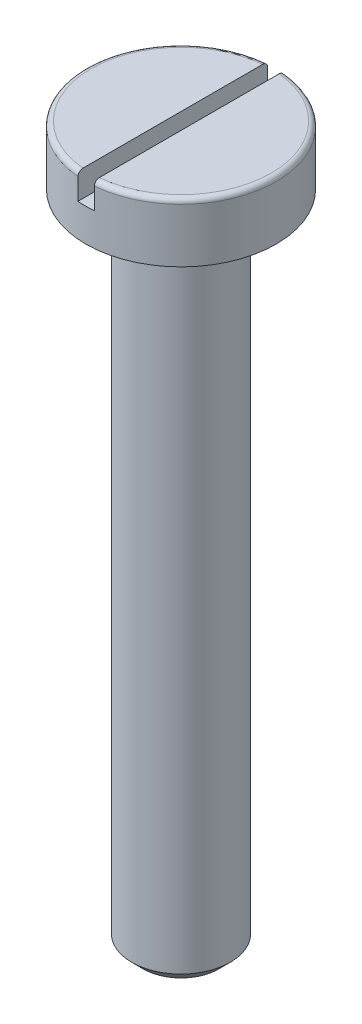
ISO-10303-21;
HEADER;
FILE_DESCRIPTION(('STEP AP214'),'2;1');
FILE_NAME('part.step','',(''),(''),'','','');
FILE_SCHEMA(('AUTOMOTIVE_DESIGN { 1 0 10303 214 1 1 1 1 }'));
ENDSEC;
DATA;
#1=APPLICATION_CONTEXT('core data for automotive mechanical design processes');
#2=APPLICATION_PROTOCOL_DEFINITION('international standard','automotive_design',2000,#1);
#3=PRODUCT_CONTEXT('',#1,'mechanical');
#4=PRODUCT('Part','Part','',(#3));
#5=PRODUCT_RELATED_PRODUCT_CATEGORY('part','',(#4));
#6=PRODUCT_DEFINITION_FORMATION('','',#4);
#7=PRODUCT_DEFINITION_CONTEXT('part definition',#1,'design');
#8=PRODUCT_DEFINITION('design','',#6,#7);
#9=PRODUCT_DEFINITION_SHAPE('','',#8);
#10=(LENGTH_UNIT() NAMED_UNIT(*) SI_UNIT(.MILLI.,.METRE.));
#11=(NAMED_UNIT(*) PLANE_ANGLE_UNIT() SI_UNIT($,.RADIAN.));
#12=(NAMED_UNIT(*) SI_UNIT($,.STERADIAN.) SOLID_ANGLE_UNIT());
#13=UNCERTAINTY_MEASURE_WITH_UNIT(LENGTH_MEASURE(1.E-05),#10,'distance_accuracy_value','');
#14=(GEOMETRIC_REPRESENTATION_CONTEXT(3) GLOBAL_UNCERTAINTY_ASSIGNED_CONTEXT((#13)) GLOBAL_UNIT_ASSIGNED_CONTEXT((#10,
#11,#12)) REPRESENTATION_CONTEXT('',''));
#15=CARTESIAN_POINT('',(0.,0.,0.));
#16=DIRECTION('',(0.,0.,1.));
#17=DIRECTION('',(1.,0.,0.));
#18=AXIS2_PLACEMENT_3D('',#15,#16,#17);
#19=CARTESIAN_POINT('',(0.,1.8,0.));
#20=DIRECTION('',(0.,1.,0.));
#21=DIRECTION('',(0.,0.,1.));
#22=AXIS2_PLACEMENT_3D('',#19,#20,#21);
#23=PLANE('',#22);
#24=DIRECTION('',(0.,0.,-1.));
#25=VECTOR('',#24,1.);
#26=CARTESIAN_POINT('',(0.25,1.8,-2.88920404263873));
#27=LINE('',#26,#25);
#28=CARTESIAN_POINT('',(0.25,1.8,2.73861278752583));
#29=VERTEX_POINT('',#28);
#30=CARTESIAN_POINT('',(0.25,1.8,-2.73861278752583));
#31=VERTEX_POINT('',#30);
#32=EDGE_CURVE('E103',#29,#31,#27,.T.);
#33=ORIENTED_EDGE('',*,*,#32,.F.);
#34=CARTESIAN_POINT('',(0.,1.8,0.));
#35=DIRECTION('',(0.,1.,0.));
#36=DIRECTION('',(0.,0.,1.));
#37=AXIS2_PLACEMENT_3D('',#34,#35,#36);
#38=CIRCLE('',#37,2.75);
#39=EDGE_CURVE('E124',#29,#31,#38,.T.);
#40=ORIENTED_EDGE('',*,*,#39,.T.);
#41=EDGE_LOOP('',(#33,#40));
#42=FACE_BOUND('',#41,.T.);
#43=ADVANCED_FACE('F33',(#42),#23,.T.);
#44=CARTESIAN_POINT('',(0.,1.65,0.));
#45=DIRECTION('',(0.,1.,0.));
#46=DIRECTION('',(0.,0.,1.));
#47=AXIS2_PLACEMENT_3D('',#44,#45,#46);
#48=TOROIDAL_SURFACE('',#47,2.75,0.15);
#49=CARTESIAN_POINT('',(0.25,1.73723236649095,-2.86112518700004));
#50=CARTESIAN_POINT('',(0.25,1.73040158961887,-2.86602640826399));
#51=CARTESIAN_POINT('',(0.25,1.72315291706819,-2.8703554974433));
#52=CARTESIAN_POINT('',(0.25,1.7080259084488,-2.87773928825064));
#53=CARTESIAN_POINT('',(0.25,1.70014685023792,-2.88079250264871));
#54=CARTESIAN_POINT('',(0.25,1.68398989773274,-2.88553057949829));
#55=CARTESIAN_POINT('',(0.25,1.67571215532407,-2.88721595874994));
#56=CARTESIAN_POINT('',(0.25,1.65899332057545,-2.88917038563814));
#57=CARTESIAN_POINT('',(0.25,1.6505522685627,-2.88943977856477));
#58=CARTESIAN_POINT('',(0.25,1.63375561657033,-2.88855608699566));
#59=CARTESIAN_POINT('',(0.25,1.62539992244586,-2.8874047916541));
#60=CARTESIAN_POINT('',(0.25,1.60900008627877,-2.8837160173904));
#61=CARTESIAN_POINT('',(0.25,1.6009559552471,-2.88117848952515));
#62=CARTESIAN_POINT('',(0.25,1.58540513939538,-2.87478974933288));
#63=CARTESIAN_POINT('',(0.25,1.5778985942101,-2.87093819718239));
#64=CARTESIAN_POINT('',(0.25,1.56363661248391,-2.86203241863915));
#65=CARTESIAN_POINT('',(0.25,1.55688118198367,-2.8569781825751));
#66=CARTESIAN_POINT('',(0.25,1.54429518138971,-2.84579805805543));
#67=CARTESIAN_POINT('',(0.25,1.53846688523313,-2.83966960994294));
#68=CARTESIAN_POINT('',(0.25,1.52791738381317,-2.82652432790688));
#69=CARTESIAN_POINT('',(0.25,1.52319619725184,-2.81950747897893));
#70=CARTESIAN_POINT('',(0.25,1.51497644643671,-2.8047571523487));
#71=CARTESIAN_POINT('',(0.25,1.51148242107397,-2.79702114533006));
#72=CARTESIAN_POINT('',(0.25,1.50583759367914,-2.78107367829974));
#73=CARTESIAN_POINT('',(0.25,1.50368682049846,-2.77286220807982));
#74=CARTESIAN_POINT('',(0.25,1.50078241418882,-2.75616625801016));
#75=CARTESIAN_POINT('',(0.25,1.50003367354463,-2.74768092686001));
#76=CARTESIAN_POINT('',(0.25,1.49996855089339,-2.73070472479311));
#77=CARTESIAN_POINT('',(0.25,1.50065218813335,-2.72221385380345));
#78=CARTESIAN_POINT('',(0.25,1.5034352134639,-2.70545148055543));
#79=CARTESIAN_POINT('',(0.25,1.50553716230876,-2.69718040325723));
#80=CARTESIAN_POINT('',(0.25,1.51110089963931,-2.68110891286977));
#81=CARTESIAN_POINT('',(0.25,1.51456268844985,-2.67330849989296));
#82=CARTESIAN_POINT('',(0.25,1.52274612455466,-2.65840742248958));
#83=CARTESIAN_POINT('',(0.25,1.52746673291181,-2.6513061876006));
#84=CARTESIAN_POINT('',(0.25,1.53803683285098,-2.63800039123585));
#85=CARTESIAN_POINT('',(0.25,1.54388630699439,-2.63179581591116));
#86=CARTESIAN_POINT('',(0.25,1.55652791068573,-2.62048206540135));
#87=CARTESIAN_POINT('',(0.25,1.56331685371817,-2.61536933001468));
#88=CARTESIAN_POINT('',(0.25,1.57765984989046,-2.60636214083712));
#89=CARTESIAN_POINT('',(0.25,1.58521388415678,-2.60246765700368));
#90=CARTESIAN_POINT('',(0.25,1.60083699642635,-2.59602542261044));
#91=CARTESIAN_POINT('',(0.25,1.60890366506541,-2.59347182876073));
#92=CARTESIAN_POINT('',(0.25,1.62535190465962,-2.58976030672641));
#93=CARTESIAN_POINT('',(0.25,1.63373346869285,-2.58860234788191));
#94=CARTESIAN_POINT('',(0.25,1.65054344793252,-2.58771759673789));
#95=CARTESIAN_POINT('',(0.25,1.6589716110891,-2.58798600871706));
#96=CARTESIAN_POINT('',(0.25,1.67566296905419,-2.58993500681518));
#97=CARTESIAN_POINT('',(0.25,1.68392616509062,-2.59161558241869));
#98=CARTESIAN_POINT('',(0.25,1.700048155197,-2.59633834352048));
#99=CARTESIAN_POINT('',(0.25,1.70790719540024,-2.59937968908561));
#100=CARTESIAN_POINT('',(0.25,1.72300487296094,-2.60673552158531));
#101=CARTESIAN_POINT('',(0.25,1.73024350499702,-2.61105001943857));
#102=CARTESIAN_POINT('',(0.25,1.74391444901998,-2.62083994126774));
#103=CARTESIAN_POINT('',(0.25,1.75034475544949,-2.62631816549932));
#104=CARTESIAN_POINT('',(0.25,1.76219922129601,-2.63827230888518));
#105=CARTESIAN_POINT('',(0.25,1.76762335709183,-2.64474825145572));
#106=CARTESIAN_POINT('',(0.25,1.77733600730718,-2.65854323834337));
#107=CARTESIAN_POINT('',(0.25,1.78161962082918,-2.66586573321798));
#108=CARTESIAN_POINT('',(0.25,1.78890235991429,-2.68112382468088));
#109=CARTESIAN_POINT('',(0.25,1.79190145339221,-2.68905943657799));
#110=CARTESIAN_POINT('',(0.25,1.79654167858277,-2.70535247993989));
#111=CARTESIAN_POINT('',(0.25,1.79817735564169,-2.71371146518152));
#112=CARTESIAN_POINT('',(0.25,1.80002507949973,-2.73058505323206));
#113=CARTESIAN_POINT('',(0.25,1.80023716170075,-2.73909965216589));
#114=CARTESIAN_POINT('',(0.25,1.79923076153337,-2.75605948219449));
#115=CARTESIAN_POINT('',(0.25,1.79800967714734,-2.76450455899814));
#116=CARTESIAN_POINT('',(0.25,1.79416544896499,-2.78107183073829));
#117=CARTESIAN_POINT('',(0.25,1.79154195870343,-2.78919394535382));
#118=CARTESIAN_POINT('',(0.25,1.78496742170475,-2.80487793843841));
#119=CARTESIAN_POINT('',(0.25,1.78101680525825,-2.81243999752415));
#120=CARTESIAN_POINT('',(0.25,1.77190073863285,-2.82678379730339));
#121=CARTESIAN_POINT('',(0.25,1.76673677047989,-2.83356647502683));
#122=CARTESIAN_POINT('',(0.25,1.75746560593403,-2.84381565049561));
#123=CARTESIAN_POINT('',(0.25,1.75367936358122,-2.84757748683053));
#124=CARTESIAN_POINT('',(0.25,1.74572890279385,-2.85467799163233));
#125=CARTESIAN_POINT('',(0.25,1.74156468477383,-2.85801666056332));
#126=CARTESIAN_POINT('',(0.25,1.73723236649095,-2.86112518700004));
#127=B_SPLINE_CURVE_WITH_KNOTS('',3,(#49,#50,#51,#52,#53,#54,#55,#56,#57,#58,#59,#60,#61,#62,
#63,#64,#65,#66,#67,#68,#69,#70,#71,#72,#73,#74,#75,#76,#77,#78,#79,#80,#81,#82,#83,#84,#85,#86,
#87,#88,#89,#90,#91,#92,#93,#94,#95,#96,#97,#98,#99,#100,#101,#102,#103,#104,#105,#106,#107,
#108,#109,#110,#111,#112,#113,#114,#115,#116,#117,#118,#119,#120,#121,#122,#123,#124,#125,#126),
.UNSPECIFIED.,.T.,.F.,(4,2,2,2,2,2,2,2,2,2,2,2,2,2,2,2,2,2,2,2,2,2,2,2,2,2,2,2,2,2,2,2,2,2,2,2,
2,2,4),(0.,0.0252022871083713,0.0504338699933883,0.0756559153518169,0.100871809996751,
0.126055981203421,0.151241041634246,0.176432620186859,0.201624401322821,0.226877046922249,
0.252130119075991,0.277475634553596,0.302821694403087,0.328256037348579,0.353690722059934,
0.379171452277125,0.404652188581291,0.430111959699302,0.455571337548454,0.480946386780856,
0.506320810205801,0.531583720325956,0.55684607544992,0.582023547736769,0.607200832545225,
0.632362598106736,0.657524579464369,0.682747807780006,0.707971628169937,0.733302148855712,
0.758633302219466,0.784065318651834,0.809496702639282,0.834974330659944,0.86045825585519,
0.885933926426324,0.911378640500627,0.927362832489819,0.94334700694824),.UNSPECIFIED.);
#128=CARTESIAN_POINT('',(0.25,1.65000000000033,-2.88920404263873));
#129=VERTEX_POINT('',#128);
#130=EDGE_CURVE('E56',#31,#129,#127,.T.);
#131=ORIENTED_EDGE('',*,*,#130,.F.);
#132=ORIENTED_EDGE('',*,*,#39,.F.);
#133=CARTESIAN_POINT('',(0.25,1.71206998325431,2.60145994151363));
#134=CARTESIAN_POINT('',(0.25,1.7044353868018,2.59797412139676));
#135=CARTESIAN_POINT('',(0.25,1.69650147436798,2.59512943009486));
#136=CARTESIAN_POINT('',(0.25,1.68026221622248,2.59081004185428));
#137=CARTESIAN_POINT('',(0.25,1.67195644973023,2.58933694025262));
#138=CARTESIAN_POINT('',(0.25,1.65521813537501,2.5878078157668));
#139=CARTESIAN_POINT('',(0.25,1.6467856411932,2.5877512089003));
#140=CARTESIAN_POINT('',(0.25,1.63003328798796,2.58905562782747));
#141=CARTESIAN_POINT('',(0.25,1.62171340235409,2.59041631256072));
#142=CARTESIAN_POINT('',(0.25,1.60542422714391,2.59451383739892));
#143=CARTESIAN_POINT('',(0.25,1.59745476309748,2.59724998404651));
#144=CARTESIAN_POINT('',(0.25,1.58208663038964,2.60401875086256));
#145=CARTESIAN_POINT('',(0.25,1.57468798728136,2.60805142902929));
#146=CARTESIAN_POINT('',(0.25,1.56065440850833,2.61730672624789));
#147=CARTESIAN_POINT('',(0.25,1.55402111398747,2.62253183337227));
#148=CARTESIAN_POINT('',(0.25,1.54172137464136,2.6340173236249));
#149=CARTESIAN_POINT('',(0.25,1.53605494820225,2.64027772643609));
#150=CARTESIAN_POINT('',(0.25,1.52582467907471,2.65368360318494));
#151=CARTESIAN_POINT('',(0.25,1.5212654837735,2.66083262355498));
#152=CARTESIAN_POINT('',(0.25,1.51340629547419,2.67579217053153));
#153=CARTESIAN_POINT('',(0.25,1.51010632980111,2.68360271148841));
#154=CARTESIAN_POINT('',(0.25,1.50484577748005,2.69969805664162));
#155=CARTESIAN_POINT('',(0.25,1.50289073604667,2.70798467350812));
#156=CARTESIAN_POINT('',(0.25,1.50039615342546,2.72476834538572));
#157=CARTESIAN_POINT('',(0.25,1.49985663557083,2.73326540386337));
#158=CARTESIAN_POINT('',(0.25,1.50020873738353,2.75024875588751));
#159=CARTESIAN_POINT('',(0.25,1.50110352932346,2.75873498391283));
#160=CARTESIAN_POINT('',(0.25,1.50430578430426,2.77543665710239));
#161=CARTESIAN_POINT('',(0.25,1.50661324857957,2.78365210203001));
#162=CARTESIAN_POINT('',(0.25,1.51257546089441,2.79957409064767));
#163=CARTESIAN_POINT('',(0.25,1.51622954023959,2.80728088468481));
#164=CARTESIAN_POINT('',(0.25,1.52478317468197,2.82196927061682));
#165=CARTESIAN_POINT('',(0.25,1.52968271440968,2.82895087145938));
#166=CARTESIAN_POINT('',(0.25,1.54057412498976,2.84196940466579));
#167=CARTESIAN_POINT('',(0.25,1.54656291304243,2.84800891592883));
#168=CARTESIAN_POINT('',(0.25,1.55947281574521,2.85899213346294));
#169=CARTESIAN_POINT('',(0.25,1.56639391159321,2.86393586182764));
#170=CARTESIAN_POINT('',(0.25,1.58094393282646,2.87256742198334));
#171=CARTESIAN_POINT('',(0.25,1.58857008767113,2.87625992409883));
#172=CARTESIAN_POINT('',(0.25,1.60433544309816,2.88230747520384));
#173=CARTESIAN_POINT('',(0.25,1.61247463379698,2.88466254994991));
#174=CARTESIAN_POINT('',(0.25,1.62900696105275,2.88796129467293));
#175=CARTESIAN_POINT('',(0.25,1.63739919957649,2.88890946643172));
#176=CARTESIAN_POINT('',(0.25,1.65422357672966,2.88938119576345));
#177=CARTESIAN_POINT('',(0.25,1.66265571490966,2.88890476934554));
#178=CARTESIAN_POINT('',(0.25,1.67930798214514,2.88654287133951));
#179=CARTESIAN_POINT('',(0.25,1.68752839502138,2.88465939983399));
#180=CARTESIAN_POINT('',(0.25,1.70353674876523,2.87954026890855));
#181=CARTESIAN_POINT('',(0.25,1.71132468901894,2.87630460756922));
#182=CARTESIAN_POINT('',(0.25,1.72625493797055,2.86857095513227));
#183=CARTESIAN_POINT('',(0.25,1.73339667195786,2.86407185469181));
#184=CARTESIAN_POINT('',(0.25,1.74682619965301,2.85394172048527));
#185=CARTESIAN_POINT('',(0.25,1.75311398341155,2.8483106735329));
#186=CARTESIAN_POINT('',(0.25,1.76467677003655,2.8360597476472));
#187=CARTESIAN_POINT('',(0.25,1.76994883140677,2.82943709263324));
#188=CARTESIAN_POINT('',(0.25,1.77931122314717,2.81540343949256));
#189=CARTESIAN_POINT('',(0.25,1.78340152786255,2.80799242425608));
#190=CARTESIAN_POINT('',(0.25,1.7903005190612,2.79256258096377));
#191=CARTESIAN_POINT('',(0.25,1.79310432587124,2.7845415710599));
#192=CARTESIAN_POINT('',(0.25,1.79733033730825,2.76814347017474));
#193=CARTESIAN_POINT('',(0.25,1.79875251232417,2.7597663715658));
#194=CARTESIAN_POINT('',(0.25,1.80017865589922,2.74286525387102));
#195=CARTESIAN_POINT('',(0.25,1.80017807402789,2.73434085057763));
#196=CARTESIAN_POINT('',(0.25,1.79874763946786,2.7174130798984));
#197=CARTESIAN_POINT('',(0.25,1.79731782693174,2.70900970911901));
#198=CARTESIAN_POINT('',(0.25,1.79306657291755,2.6925529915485));
#199=CARTESIAN_POINT('',(0.25,1.79024364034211,2.68450002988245));
#200=CARTESIAN_POINT('',(0.25,1.78328294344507,2.66898121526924));
#201=CARTESIAN_POINT('',(0.25,1.77914485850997,2.66151550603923));
#202=CARTESIAN_POINT('',(0.25,1.76967589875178,2.64739572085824));
#203=CARTESIAN_POINT('',(0.25,1.76434629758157,2.64074078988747));
#204=CARTESIAN_POINT('',(0.25,1.75264521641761,2.62843088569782));
#205=CARTESIAN_POINT('',(0.25,1.74627501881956,2.62277469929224));
#206=CARTESIAN_POINT('',(0.25,1.73521463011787,2.61451596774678));
#207=CARTESIAN_POINT('',(0.25,1.73078297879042,2.6115609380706));
#208=CARTESIAN_POINT('',(0.25,1.72163098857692,2.60613800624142));
#209=CARTESIAN_POINT('',(0.25,1.71691065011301,2.60367010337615));
#210=CARTESIAN_POINT('',(0.25,1.71206998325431,2.60145994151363));
#211=B_SPLINE_CURVE_WITH_KNOTS('',3,(#133,#134,#135,#136,#137,#138,#139,#140,#141,#142,#143,
#144,#145,#146,#147,#148,#149,#150,#151,#152,#153,#154,#155,#156,#157,#158,#159,#160,#161,#162,
#163,#164,#165,#166,#167,#168,#169,#170,#171,#172,#173,#174,#175,#176,#177,#178,#179,#180,#181,
#182,#183,#184,#185,#186,#187,#188,#189,#190,#191,#192,#193,#194,#195,#196,#197,#198,#199,#200,
#201,#202,#203,#204,#205,#206,#207,#208,#209,#210),.UNSPECIFIED.,.T.,.F.,(4,2,2,2,2,2,2,2,2,2,2,
2,2,2,2,2,2,2,2,2,2,2,2,2,2,2,2,2,2,2,2,2,2,2,2,2,2,2,4),(0.,0.0251588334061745,
0.0503468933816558,0.0755245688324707,0.100696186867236,0.125855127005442,0.151015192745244,
0.17622824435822,0.20144177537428,0.226759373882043,0.252077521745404,0.277499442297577,
0.302921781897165,0.328400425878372,0.353879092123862,0.379345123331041,0.404810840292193,
0.430205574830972,0.455599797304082,0.480898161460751,0.506196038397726,0.531412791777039,
0.556629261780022,0.581809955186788,0.606990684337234,0.6321935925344,0.657396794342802,
0.68267192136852,0.70794759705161,0.733318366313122,0.758689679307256,0.784142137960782,
0.809593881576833,0.83507292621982,0.860558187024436,0.886016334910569,0.911443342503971,
0.927395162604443,0.943346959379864),.UNSPECIFIED.);
#212=CARTESIAN_POINT('',(0.249999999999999,1.65,2.88920404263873));
#213=VERTEX_POINT('',#212);
#214=EDGE_CURVE('E181',#213,#29,#211,.T.);
#215=ORIENTED_EDGE('',*,*,#214,.F.);
#216=CARTESIAN_POINT('',(0.,1.65,0.));
#217=DIRECTION('',(0.,1.,0.));
#218=DIRECTION('',(0.,0.,1.));
#219=AXIS2_PLACEMENT_3D('',#216,#217,#218);
#220=CIRCLE('',#219,2.9);
#221=EDGE_CURVE('E127',#129,#213,#220,.F.);
#222=ORIENTED_EDGE('',*,*,#221,.F.);
#223=EDGE_LOOP('',(#131,#132,#215,#222));
#224=FACE_BOUND('',#223,.T.);
#225=ADVANCED_FACE('F164',(#224),#48,.T.);
#226=CARTESIAN_POINT('',(0.,-20.,0.));
#227=DIRECTION('',(0.,1.,0.));
#228=DIRECTION('',(0.,0.,1.));
#229=AXIS2_PLACEMENT_3D('',#226,#227,#228);
#230=CYLINDRICAL_SURFACE('',#229,1.5);
#231=CARTESIAN_POINT('',(0.,-19.65,0.));
#232=DIRECTION('',(0.,1.,0.));
#233=DIRECTION('',(0.,0.,1.));
#234=AXIS2_PLACEMENT_3D('',#231,#232,#233);
#235=CIRCLE('',#234,1.5);
#236=CARTESIAN_POINT('',(0.,-19.65,1.5));
#237=VERTEX_POINT('',#236);
#238=EDGE_CURVE('E41',#237,#237,#235,.T.);
#239=ORIENTED_EDGE('',*,*,#238,.T.);
#240=EDGE_LOOP('',(#239));
#241=FACE_BOUND('',#240,.T.);
#242=CARTESIAN_POINT('',(0.,0.,0.));
#243=DIRECTION('',(0.,1.,0.));
#244=DIRECTION('',(0.,0.,1.));
#245=AXIS2_PLACEMENT_3D('',#242,#243,#244);
#246=CIRCLE('',#245,1.5);
#247=CARTESIAN_POINT('',(0.,0.,1.5));
#248=VERTEX_POINT('',#247);
#249=EDGE_CURVE('E119',#248,#248,#246,.T.);
#250=ORIENTED_EDGE('',*,*,#249,.F.);
#251=EDGE_LOOP('',(#250));
#252=FACE_BOUND('',#251,.T.);
#253=ADVANCED_FACE('F161',(#241,#252),#230,.T.);
#254=CARTESIAN_POINT('',(0.,-20.,0.));
#255=DIRECTION('',(0.,1.,0.));
#256=DIRECTION('',(0.,0.,1.));
#257=AXIS2_PLACEMENT_3D('',#254,#255,#256);
#258=PLANE('',#257);
#259=CARTESIAN_POINT('',(0.,-20.,0.));
#260=DIRECTION('',(0.,1.,0.));
#261=DIRECTION('',(0.,0.,1.));
#262=AXIS2_PLACEMENT_3D('',#259,#260,#261);
#263=CIRCLE('',#262,1.15);
#264=CARTESIAN_POINT('',(0.,-20.,1.15));
#265=VERTEX_POINT('',#264);
#266=EDGE_CURVE('E11',#265,#265,#263,.F.);
#267=ORIENTED_EDGE('',*,*,#266,.T.);
#268=EDGE_LOOP('',(#267));
#269=FACE_BOUND('',#268,.T.);
#270=ADVANCED_FACE('F159',(#269),#258,.F.);
#271=CARTESIAN_POINT('',(0.,1.8,0.));
#272=DIRECTION('',(0.,-1.,0.));
#273=DIRECTION('',(0.,0.,-1.));
#274=AXIS2_PLACEMENT_3D('',#271,#272,#273);
#275=CYLINDRICAL_SURFACE('',#274,2.9);
#276=CARTESIAN_POINT('',(0.,1.,0.));
#277=DIRECTION('',(0.,1.,0.));
#278=DIRECTION('',(0.,0.,1.));
#279=AXIS2_PLACEMENT_3D('',#276,#277,#278);
#280=CIRCLE('',#279,2.9);
#281=CARTESIAN_POINT('',(0.25,1.,-2.88920404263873));
#282=VERTEX_POINT('',#281);
#283=CARTESIAN_POINT('',(-0.25,1.,-2.88920404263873));
#284=VERTEX_POINT('',#283);
#285=EDGE_CURVE('E95',#282,#284,#280,.T.);
#286=ORIENTED_EDGE('',*,*,#285,.F.);
#287=DIRECTION('',(0.,1.,0.));
#288=VECTOR('',#287,1.);
#289=CARTESIAN_POINT('',(0.25,1.,-2.88920404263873));
#290=LINE('',#289,#288);
#291=EDGE_CURVE('E120',#282,#129,#290,.T.);
#292=ORIENTED_EDGE('',*,*,#291,.T.);
#293=ORIENTED_EDGE('',*,*,#221,.T.);
#294=DIRECTION('',(0.,1.,0.));
#295=VECTOR('',#294,1.);
#296=CARTESIAN_POINT('',(0.249999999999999,1.,2.88920404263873));
#297=LINE('',#296,#295);
#298=CARTESIAN_POINT('',(0.249999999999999,1.,2.88920404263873));
#299=VERTEX_POINT('',#298);
#300=EDGE_CURVE('E111',#299,#213,#297,.T.);
#301=ORIENTED_EDGE('',*,*,#300,.F.);
#302=CARTESIAN_POINT('',(0.,1.,0.));
#303=DIRECTION('',(0.,1.,0.));
#304=DIRECTION('',(0.,0.,1.));
#305=AXIS2_PLACEMENT_3D('',#302,#303,#304);
#306=CIRCLE('',#305,2.9);
#307=CARTESIAN_POINT('',(-0.25,1.,2.88920404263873));
#308=VERTEX_POINT('',#307);
#309=EDGE_CURVE('E94',#308,#299,#306,.T.);
#310=ORIENTED_EDGE('',*,*,#309,.F.);
#311=DIRECTION('',(0.,1.,0.));
#312=VECTOR('',#311,1.);
#313=CARTESIAN_POINT('',(-0.25,1.,2.88920404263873));
#314=LINE('',#313,#312);
#315=CARTESIAN_POINT('',(-0.25,1.65,2.88920404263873));
#316=VERTEX_POINT('',#315);
#317=EDGE_CURVE('E91',#308,#316,#314,.T.);
#318=ORIENTED_EDGE('',*,*,#317,.T.);
#319=CARTESIAN_POINT('',(-0.25,1.64999999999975,-2.88920404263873));
#320=VERTEX_POINT('',#319);
#321=EDGE_CURVE('E109',#316,#320,#220,.F.);
#322=ORIENTED_EDGE('',*,*,#321,.T.);
#323=DIRECTION('',(0.,1.,0.));
#324=VECTOR('',#323,1.);
#325=CARTESIAN_POINT('',(-0.25,1.,-2.88920404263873));
#326=LINE('',#325,#324);
#327=EDGE_CURVE('E88',#284,#320,#326,.T.);
#328=ORIENTED_EDGE('',*,*,#327,.F.);
#329=EDGE_LOOP('',(#286,#292,#293,#301,#310,#318,#322,#328));
#330=FACE_BOUND('',#329,.T.);
#331=CARTESIAN_POINT('',(0.,0.,0.));
#332=DIRECTION('',(0.,1.,0.));
#333=DIRECTION('',(0.,0.,1.));
#334=AXIS2_PLACEMENT_3D('',#331,#332,#333);
#335=CIRCLE('',#334,2.9);
#336=CARTESIAN_POINT('',(0.,0.,2.9));
#337=VERTEX_POINT('',#336);
#338=EDGE_CURVE('E116',#337,#337,#335,.T.);
#339=ORIENTED_EDGE('',*,*,#338,.T.);
#340=EDGE_LOOP('',(#339));
#341=FACE_BOUND('',#340,.T.);
#342=ADVANCED_FACE('F106',(#330,#341),#275,.T.);
#343=DIRECTION('',(0.,0.,1.));
#344=VECTOR('',#343,1.);
#345=CARTESIAN_POINT('',(-0.25,1.8,-2.88920404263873));
#346=LINE('',#345,#344);
#347=CARTESIAN_POINT('',(-0.25,1.8,-2.73861278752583));
#348=VERTEX_POINT('',#347);
#349=CARTESIAN_POINT('',(-0.25,1.8,2.73861278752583));
#350=VERTEX_POINT('',#349);
#351=EDGE_CURVE('E48',#348,#350,#346,.T.);
#352=ORIENTED_EDGE('',*,*,#351,.F.);
#353=EDGE_CURVE('E123',#348,#350,#38,.T.);
#354=ORIENTED_EDGE('',*,*,#353,.T.);
#355=EDGE_LOOP('',(#352,#354));
#356=FACE_BOUND('',#355,.T.);
#357=ADVANCED_FACE('F148',(#356),#23,.T.);
#358=CARTESIAN_POINT('',(0.,0.,0.));
#359=DIRECTION('',(0.,1.,0.));
#360=DIRECTION('',(0.,0.,1.));
#361=AXIS2_PLACEMENT_3D('',#358,#359,#360);
#362=PLANE('',#361);
#363=ORIENTED_EDGE('',*,*,#249,.T.);
#364=EDGE_LOOP('',(#363));
#365=FACE_BOUND('',#364,.T.);
#366=ORIENTED_EDGE('',*,*,#338,.F.);
#367=EDGE_LOOP('',(#366));
#368=FACE_BOUND('',#367,.T.);
#369=ADVANCED_FACE('F152',(#365,#368),#362,.F.);
#370=CARTESIAN_POINT('',(-0.25,1.73723236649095,-2.86112518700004));
#371=CARTESIAN_POINT('',(-0.25,1.74409710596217,-2.85619866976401));
#372=CARTESIAN_POINT('',(-0.25,1.75054970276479,-2.85068705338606));
#373=CARTESIAN_POINT('',(-0.25,1.76244214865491,-2.83865301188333));
#374=CARTESIAN_POINT('',(-0.25,1.76788072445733,-2.83212933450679));
#375=CARTESIAN_POINT('',(-0.25,1.77758335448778,-2.8182657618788));
#376=CARTESIAN_POINT('',(-0.25,1.78184815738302,-2.81092639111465));
#377=CARTESIAN_POINT('',(-0.25,1.78908762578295,-2.79563940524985));
#378=CARTESIAN_POINT('',(-0.25,1.7920626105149,-2.78769194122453));
#379=CARTESIAN_POINT('',(-0.25,1.79664885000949,-2.77138873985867));
#380=CARTESIAN_POINT('',(-0.25,1.79825626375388,-2.76303192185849));
#381=CARTESIAN_POINT('',(-0.25,1.80004915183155,-2.7461667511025));
#382=CARTESIAN_POINT('',(-0.25,1.80023454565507,-2.73765838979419));
#383=CARTESIAN_POINT('',(-0.25,1.79917713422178,-2.72070995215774));
#384=CARTESIAN_POINT('',(-0.25,1.79793084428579,-2.7122700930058));
#385=CARTESIAN_POINT('',(-0.25,1.79403913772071,-2.69571929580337));
#386=CARTESIAN_POINT('',(-0.25,1.79139371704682,-2.68760835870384));
#387=CARTESIAN_POINT('',(-0.25,1.78477731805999,-2.67194613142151));
#388=CARTESIAN_POINT('',(-0.25,1.78080631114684,-2.66439485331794));
#389=CARTESIAN_POINT('',(-0.25,1.77164971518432,-2.65006849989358));
#390=CARTESIAN_POINT('',(-0.25,1.76646414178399,-2.64329341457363));
#391=CARTESIAN_POINT('',(-0.25,1.75503950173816,-2.63073173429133));
#392=CARTESIAN_POINT('',(-0.25,1.74880326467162,-2.62494256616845));
#393=CARTESIAN_POINT('',(-0.25,1.73544376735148,-2.61449878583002));
#394=CARTESIAN_POINT('',(-0.25,1.72832052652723,-2.60984414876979));
#395=CARTESIAN_POINT('',(-0.25,1.71342180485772,-2.60182282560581));
#396=CARTESIAN_POINT('',(-0.25,1.70564924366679,-2.59845071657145));
#397=CARTESIAN_POINT('',(-0.25,1.68964689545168,-2.59306508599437));
#398=CARTESIAN_POINT('',(-0.25,1.6814171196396,-2.59105153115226));
#399=CARTESIAN_POINT('',(-0.25,1.66476838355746,-2.58844730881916));
#400=CARTESIAN_POINT('',(-0.25,1.65635028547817,-2.5878511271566));
#401=CARTESIAN_POINT('',(-0.25,1.63953378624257,-2.58808295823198));
#402=CARTESIAN_POINT('',(-0.25,1.63113538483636,-2.58891095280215));
#403=CARTESIAN_POINT('',(-0.25,1.61461026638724,-2.59196444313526));
#404=CARTESIAN_POINT('',(-0.25,1.60648314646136,-2.59418775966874));
#405=CARTESIAN_POINT('',(-0.25,1.59071664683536,-2.59996517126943));
#406=CARTESIAN_POINT('',(-0.25,1.58307726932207,-2.60351927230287));
#407=CARTESIAN_POINT('',(-0.25,1.56848945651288,-2.61186208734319));
#408=CARTESIAN_POINT('',(-0.25,1.56154213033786,-2.6166527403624));
#409=CARTESIAN_POINT('',(-0.25,1.5485463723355,-2.62732820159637));
#410=CARTESIAN_POINT('',(-0.25,1.54249795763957,-2.63321303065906));
#411=CARTESIAN_POINT('',(-0.25,1.53144628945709,-2.64593398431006));
#412=CARTESIAN_POINT('',(-0.25,1.52644719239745,-2.65277371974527));
#413=CARTESIAN_POINT('',(-0.25,1.51766247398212,-2.66719247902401));
#414=CARTESIAN_POINT('',(-0.25,1.51387688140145,-2.67477152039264));
#415=CARTESIAN_POINT('',(-0.25,1.50761014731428,-2.69048854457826));
#416=CARTESIAN_POINT('',(-0.25,1.50513463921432,-2.69862877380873));
#417=CARTESIAN_POINT('',(-0.25,1.50158127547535,-2.71520880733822));
#418=CARTESIAN_POINT('',(-0.25,1.50050344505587,-2.72364861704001));
#419=CARTESIAN_POINT('',(-0.25,1.49977449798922,-2.74061233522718));
#420=CARTESIAN_POINT('',(-0.25,1.50012720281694,-2.74913640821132));
#421=CARTESIAN_POINT('',(-0.25,1.5022585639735,-2.76600443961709));
#422=CARTESIAN_POINT('',(-0.25,1.50403722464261,-2.77434839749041));
#423=CARTESIAN_POINT('',(-0.25,1.50897148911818,-2.79061902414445));
#424=CARTESIAN_POINT('',(-0.25,1.51212711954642,-2.79854568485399));
#425=CARTESIAN_POINT('',(-0.25,1.51972752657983,-2.81375489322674));
#426=CARTESIAN_POINT('',(-0.25,1.52417229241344,-2.82103744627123));
#427=CARTESIAN_POINT('',(-0.25,1.53421390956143,-2.83473217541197));
#428=CARTESIAN_POINT('',(-0.25,1.5398079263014,-2.84114642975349));
#429=CARTESIAN_POINT('',(-0.25,1.55199704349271,-2.85294041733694));
#430=CARTESIAN_POINT('',(-0.25,1.55859212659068,-2.85832016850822));
#431=CARTESIAN_POINT('',(-0.25,1.57257011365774,-2.86787122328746));
#432=CARTESIAN_POINT('',(-0.25,1.57995002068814,-2.872046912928));
#433=CARTESIAN_POINT('',(-0.25,1.59530763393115,-2.87909494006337));
#434=CARTESIAN_POINT('',(-0.25,1.60328530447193,-2.88196735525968));
#435=CARTESIAN_POINT('',(-0.25,1.61958192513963,-2.88631768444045));
#436=CARTESIAN_POINT('',(-0.25,1.62789957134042,-2.88780048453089));
#437=CARTESIAN_POINT('',(-0.25,1.64466803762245,-2.88934604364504));
#438=CARTESIAN_POINT('',(-0.25,1.65311888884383,-2.88940846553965));
#439=CARTESIAN_POINT('',(-0.25,1.66989855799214,-2.88811200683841));
#440=CARTESIAN_POINT('',(-0.25,1.6782275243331,-2.88675503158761));
#441=CARTESIAN_POINT('',(-0.25,1.69453216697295,-2.88266253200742));
#442=CARTESIAN_POINT('',(-0.25,1.70250825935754,-2.87992868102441));
#443=CARTESIAN_POINT('',(-0.25,1.71495297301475,-2.8744565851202));
#444=CARTESIAN_POINT('',(-0.25,1.71960078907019,-2.87211632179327));
#445=CARTESIAN_POINT('',(-0.25,1.72862853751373,-2.86696627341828));
#446=CARTESIAN_POINT('',(-0.25,1.73300847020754,-2.86415648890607));
#447=CARTESIAN_POINT('',(-0.25,1.73723236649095,-2.86112518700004));
#448=B_SPLINE_CURVE_WITH_KNOTS('',3,(#370,#371,#372,#373,#374,#375,#376,#377,#378,#379,#380,
#381,#382,#383,#384,#385,#386,#387,#388,#389,#390,#391,#392,#393,#394,#395,#396,#397,#398,#399,
#400,#401,#402,#403,#404,#405,#406,#407,#408,#409,#410,#411,#412,#413,#414,#415,#416,#417,#418,
#419,#420,#421,#422,#423,#424,#425,#426,#427,#428,#429,#430,#431,#432,#433,#434,#435,#436,#437,
#438,#439,#440,#441,#442,#443,#444,#445,#446,#447),.UNSPECIFIED.,.T.,.F.,(4,2,2,2,2,2,2,2,2,2,2,
2,2,2,2,2,2,2,2,2,2,2,2,2,2,2,2,2,2,2,2,2,2,2,2,2,2,2,4),(0.,0.0253296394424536,
0.0506908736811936,0.07603589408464,0.101374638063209,0.126784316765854,0.152195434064,
0.177668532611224,0.203141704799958,0.228615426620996,0.25408882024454,0.279494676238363,
0.304899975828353,0.330196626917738,0.355492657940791,0.380690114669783,0.405887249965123,
0.431045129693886,0.456203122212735,0.481400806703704,0.506598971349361,0.531895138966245,
0.557191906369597,0.58259658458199,0.608001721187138,0.633474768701,0.658947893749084,
0.684421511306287,0.709894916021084,0.735306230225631,0.76071710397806,0.786034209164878,
0.811349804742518,0.836576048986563,0.861808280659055,0.887006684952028,0.912174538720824,
0.927759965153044,0.943345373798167),.UNSPECIFIED.);
#449=EDGE_CURVE('E134',#320,#348,#448,.T.);
#450=ORIENTED_EDGE('',*,*,#449,.F.);
#451=ORIENTED_EDGE('',*,*,#321,.F.);
#452=CARTESIAN_POINT('',(-0.25,1.71206998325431,2.60145994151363));
#453=CARTESIAN_POINT('',(-0.25,1.71974260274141,2.60496395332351));
#454=CARTESIAN_POINT('',(-0.25,1.72712405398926,2.60912067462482));
#455=CARTESIAN_POINT('',(-0.25,1.74108930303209,2.61861941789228));
#456=CARTESIAN_POINT('',(-0.25,1.7476720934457,2.62396291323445));
#457=CARTESIAN_POINT('',(-0.25,1.75984420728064,2.63567519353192));
#458=CARTESIAN_POINT('',(-0.25,1.7654341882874,2.64204329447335));
#459=CARTESIAN_POINT('',(-0.25,1.77546815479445,2.6556231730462));
#460=CARTESIAN_POINT('',(-0.25,1.77991242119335,2.66283474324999));
#461=CARTESIAN_POINT('',(-0.25,1.78754693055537,2.67792359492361));
#462=CARTESIAN_POINT('',(-0.25,1.79073299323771,2.68580299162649));
#463=CARTESIAN_POINT('',(-0.25,1.79574206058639,2.70198410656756));
#464=CARTESIAN_POINT('',(-0.25,1.79756498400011,2.71028584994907));
#465=CARTESIAN_POINT('',(-0.25,1.79980072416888,2.72710448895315));
#466=CARTESIAN_POINT('',(-0.25,1.80020896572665,2.73562199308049));
#467=CARTESIAN_POINT('',(-0.25,1.79959091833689,2.75260484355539));
#468=CARTESIAN_POINT('',(-0.25,1.79856462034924,2.76107018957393));
#469=CARTESIAN_POINT('',(-0.25,1.79510424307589,2.77771488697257));
#470=CARTESIAN_POINT('',(-0.25,1.7926690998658,2.78589401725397));
#471=CARTESIAN_POINT('',(-0.25,1.78645769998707,2.8017261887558));
#472=CARTESIAN_POINT('',(-0.25,1.78268145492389,2.80937923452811));
#473=CARTESIAN_POINT('',(-0.25,1.77390166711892,2.82392612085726));
#474=CARTESIAN_POINT('',(-0.25,1.76890043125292,2.83082135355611));
#475=CARTESIAN_POINT('',(-0.25,1.75780754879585,2.84367054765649));
#476=CARTESIAN_POINT('',(-0.25,1.7517159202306,2.84962452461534));
#477=CARTESIAN_POINT('',(-0.25,1.73863797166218,2.86039961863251));
#478=CARTESIAN_POINT('',(-0.25,1.7316548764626,2.86522464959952));
#479=CARTESIAN_POINT('',(-0.25,1.71697537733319,2.87362881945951));
#480=CARTESIAN_POINT('',(-0.25,1.70927898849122,2.8772079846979));
#481=CARTESIAN_POINT('',(-0.25,1.69342158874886,2.88300551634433));
#482=CARTESIAN_POINT('',(-0.25,1.68526237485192,2.88522879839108));
#483=CARTESIAN_POINT('',(-0.25,1.66868616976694,2.88827039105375));
#484=CARTESIAN_POINT('',(-0.25,1.6602691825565,2.88908872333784));
#485=CARTESIAN_POINT('',(-0.25,1.6434373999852,2.8892963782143));
#486=CARTESIAN_POINT('',(-0.25,1.63502264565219,2.88868904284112));
#487=CARTESIAN_POINT('',(-0.25,1.61841467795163,2.88606994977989));
#488=CARTESIAN_POINT('',(-0.25,1.61022146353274,2.88405819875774));
#489=CARTESIAN_POINT('',(-0.25,1.59429020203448,2.8786889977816));
#490=CARTESIAN_POINT('',(-0.25,1.58655207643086,2.87533178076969));
#491=CARTESIAN_POINT('',(-0.25,1.57174770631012,2.8673684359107));
#492=CARTESIAN_POINT('',(-0.25,1.56468146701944,2.86276229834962));
#493=CARTESIAN_POINT('',(-0.25,1.55140537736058,2.85242249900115));
#494=CARTESIAN_POINT('',(-0.25,1.54519731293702,2.84668654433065));
#495=CARTESIAN_POINT('',(-0.25,1.53382815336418,2.83425706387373));
#496=CARTESIAN_POINT('',(-0.25,1.52866707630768,2.82756352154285));
#497=CARTESIAN_POINT('',(-0.25,1.51951883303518,2.81338381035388));
#498=CARTESIAN_POINT('',(-0.25,1.51553586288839,2.80589493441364));
#499=CARTESIAN_POINT('',(-0.25,1.50887849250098,2.79035654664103));
#500=CARTESIAN_POINT('',(-0.25,1.50620411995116,2.78230702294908));
#501=CARTESIAN_POINT('',(-0.25,1.50223015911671,2.76584441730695));
#502=CARTESIAN_POINT('',(-0.25,1.5009356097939,2.757430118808));
#503=CARTESIAN_POINT('',(-0.25,1.49977405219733,2.74050353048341));
#504=CARTESIAN_POINT('',(-0.25,1.49990706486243,2.73199123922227));
#505=CARTESIAN_POINT('',(-0.25,1.50159857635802,2.7150901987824));
#506=CARTESIAN_POINT('',(-0.25,1.5031602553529,2.70670176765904));
#507=CARTESIAN_POINT('',(-0.25,1.50767008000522,2.69030616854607));
#508=CARTESIAN_POINT('',(-0.25,1.51061823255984,2.68229900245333));
#509=CARTESIAN_POINT('',(-0.25,1.51781782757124,2.6668964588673));
#510=CARTESIAN_POINT('',(-0.25,1.52206889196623,2.65950090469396));
#511=CARTESIAN_POINT('',(-0.25,1.53175571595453,2.64553115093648));
#512=CARTESIAN_POINT('',(-0.25,1.53719146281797,2.63895694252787));
#513=CARTESIAN_POINT('',(-0.25,1.54907726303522,2.62683756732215));
#514=CARTESIAN_POINT('',(-0.25,1.55552434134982,2.62128948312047));
#515=CARTESIAN_POINT('',(-0.25,1.56926165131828,2.61136030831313));
#516=CARTESIAN_POINT('',(-0.25,1.57655182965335,2.6069791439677));
#517=CARTESIAN_POINT('',(-0.25,1.59173381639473,2.59952843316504));
#518=CARTESIAN_POINT('',(-0.25,1.59962280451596,2.59645313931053));
#519=CARTESIAN_POINT('',(-0.25,1.61580846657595,2.59167557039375));
#520=CARTESIAN_POINT('',(-0.25,1.62410523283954,2.58997360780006));
#521=CARTESIAN_POINT('',(-0.25,1.64083891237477,2.58799690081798));
#522=CARTESIAN_POINT('',(-0.25,1.64927528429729,2.58771754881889));
#523=CARTESIAN_POINT('',(-0.25,1.66606760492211,2.58858259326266));
#524=CARTESIAN_POINT('',(-0.25,1.67442363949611,2.58972524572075));
#525=CARTESIAN_POINT('',(-0.25,1.68768278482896,2.5926923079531));
#526=CARTESIAN_POINT('',(-0.25,1.69268547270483,2.59408949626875));
#527=CARTESIAN_POINT('',(-0.25,1.70251883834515,2.59739541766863));
#528=CARTESIAN_POINT('',(-0.25,1.70734951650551,2.59930414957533));
#529=CARTESIAN_POINT('',(-0.25,1.71206998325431,2.60145994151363));
#530=B_SPLINE_CURVE_WITH_KNOTS('',3,(#452,#453,#454,#455,#456,#457,#458,#459,#460,#461,#462,
#463,#464,#465,#466,#467,#468,#469,#470,#471,#472,#473,#474,#475,#476,#477,#478,#479,#480,#481,
#482,#483,#484,#485,#486,#487,#488,#489,#490,#491,#492,#493,#494,#495,#496,#497,#498,#499,#500,
#501,#502,#503,#504,#505,#506,#507,#508,#509,#510,#511,#512,#513,#514,#515,#516,#517,#518,#519,
#520,#521,#522,#523,#524,#525,#526,#527,#528,#529),.UNSPECIFIED.,.T.,.F.,(4,2,2,2,2,2,2,2,2,2,2,
2,2,2,2,2,2,2,2,2,2,2,2,2,2,2,2,2,2,2,2,2,2,2,2,2,2,2,4),(0.,0.0252855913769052,
0.0506027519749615,0.0759030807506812,0.101197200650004,0.126574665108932,0.151953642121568,
0.177414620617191,0.202875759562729,0.228356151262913,0.253836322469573,0.279268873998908,
0.304701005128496,0.330043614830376,0.355385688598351,0.380635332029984,0.405884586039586,
0.431074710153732,0.456264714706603,0.481450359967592,0.506636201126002,0.531873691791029,
0.557111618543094,0.582438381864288,0.607765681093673,0.633185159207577,0.658605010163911,
0.684081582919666,0.70955828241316,0.735027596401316,0.760496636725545,0.785892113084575,
0.811285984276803,0.836566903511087,0.861853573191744,0.887058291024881,0.912232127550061,
0.927788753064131,0.943345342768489),.UNSPECIFIED.);
#531=EDGE_CURVE('E129',#350,#316,#530,.T.);
#532=ORIENTED_EDGE('',*,*,#531,.F.);
#533=ORIENTED_EDGE('',*,*,#353,.F.);
#534=EDGE_LOOP('',(#450,#451,#532,#533));
#535=FACE_BOUND('',#534,.T.);
#536=ADVANCED_FACE('F138',(#535),#48,.T.);
#537=CARTESIAN_POINT('',(0.25,1.,-2.88920404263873));
#538=DIRECTION('',(1.,0.,0.));
#539=DIRECTION('',(0.,0.,-1.));
#540=AXIS2_PLACEMENT_3D('',#537,#538,#539);
#541=PLANE('',#540);
#542=ORIENTED_EDGE('',*,*,#130,.T.);
#543=ORIENTED_EDGE('',*,*,#291,.F.);
#544=DIRECTION('',(0.,0.,-1.));
#545=VECTOR('',#544,1.);
#546=CARTESIAN_POINT('',(0.25,1.,-2.88920404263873));
#547=LINE('',#546,#545);
#548=EDGE_CURVE('E101',#299,#282,#547,.T.);
#549=ORIENTED_EDGE('',*,*,#548,.F.);
#550=ORIENTED_EDGE('',*,*,#300,.T.);
#551=ORIENTED_EDGE('',*,*,#214,.T.);
#552=ORIENTED_EDGE('',*,*,#32,.T.);
#553=EDGE_LOOP('',(#542,#543,#549,#550,#551,#552));
#554=FACE_BOUND('',#553,.T.);
#555=ADVANCED_FACE('F145',(#554),#541,.F.);
#556=CARTESIAN_POINT('',(-0.25,1.,-2.88920404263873));
#557=DIRECTION('',(-1.,0.,0.));
#558=DIRECTION('',(0.,0.,1.));
#559=AXIS2_PLACEMENT_3D('',#556,#557,#558);
#560=PLANE('',#559);
#561=ORIENTED_EDGE('',*,*,#449,.T.);
#562=ORIENTED_EDGE('',*,*,#351,.T.);
#563=ORIENTED_EDGE('',*,*,#531,.T.);
#564=ORIENTED_EDGE('',*,*,#317,.F.);
#565=DIRECTION('',(0.,0.,1.));
#566=VECTOR('',#565,1.);
#567=CARTESIAN_POINT('',(-0.25,1.,-2.88920404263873));
#568=LINE('',#567,#566);
#569=EDGE_CURVE('E84',#284,#308,#568,.T.);
#570=ORIENTED_EDGE('',*,*,#569,.F.);
#571=ORIENTED_EDGE('',*,*,#327,.T.);
#572=EDGE_LOOP('',(#561,#562,#563,#564,#570,#571));
#573=FACE_BOUND('',#572,.T.);
#574=ADVANCED_FACE('F86',(#573),#560,.F.);
#575=CARTESIAN_POINT('',(0.,1.,0.));
#576=DIRECTION('',(0.,1.,0.));
#577=DIRECTION('',(0.,0.,1.));
#578=AXIS2_PLACEMENT_3D('',#575,#576,#577);
#579=PLANE('',#578);
#580=ORIENTED_EDGE('',*,*,#285,.T.);
#581=ORIENTED_EDGE('',*,*,#569,.T.);
#582=ORIENTED_EDGE('',*,*,#309,.T.);
#583=ORIENTED_EDGE('',*,*,#548,.T.);
#584=EDGE_LOOP('',(#580,#581,#582,#583));
#585=FACE_BOUND('',#584,.T.);
#586=ADVANCED_FACE('F99',(#585),#579,.T.);
#587=CARTESIAN_POINT('',(0.,-19.65,0.));
#588=DIRECTION('',(0.,1.,0.));
#589=DIRECTION('',(0.,0.,1.));
#590=AXIS2_PLACEMENT_3D('',#587,#588,#589);
#591=CONICAL_SURFACE('',#590,1.5,0.785398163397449);
#592=CARTESIAN_POINT('',(0.,-20.,1.15));
#593=CARTESIAN_POINT('',(0.,-19.9963541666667,1.15364583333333));
#594=CARTESIAN_POINT('',(0.,-19.9927083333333,1.15729166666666));
#595=CARTESIAN_POINT('',(0.,-19.9854166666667,1.16458333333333));
#596=CARTESIAN_POINT('',(0.,-19.9817708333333,1.16822916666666));
#597=CARTESIAN_POINT('',(0.,-19.9744791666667,1.17552083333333));
#598=CARTESIAN_POINT('',(0.,-19.9708333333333,1.17916666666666));
#599=CARTESIAN_POINT('',(0.,-19.9635416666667,1.18645833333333));
#600=CARTESIAN_POINT('',(0.,-19.9598958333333,1.19010416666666));
#601=CARTESIAN_POINT('',(0.,-19.9526041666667,1.19739583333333));
#602=CARTESIAN_POINT('',(0.,-19.9489583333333,1.20104166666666));
#603=CARTESIAN_POINT('',(0.,-19.9416666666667,1.20833333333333));
#604=CARTESIAN_POINT('',(0.,-19.9380208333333,1.21197916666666));
#605=CARTESIAN_POINT('',(0.,-19.9307291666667,1.21927083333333));
#606=CARTESIAN_POINT('',(0.,-19.9270833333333,1.22291666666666));
#607=CARTESIAN_POINT('',(0.,-19.9197916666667,1.23020833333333));
#608=CARTESIAN_POINT('',(0.,-19.9161458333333,1.23385416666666));
#609=CARTESIAN_POINT('',(0.,-19.9088541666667,1.24114583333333));
#610=CARTESIAN_POINT('',(0.,-19.9052083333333,1.24479166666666));
#611=CARTESIAN_POINT('',(0.,-19.8979166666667,1.25208333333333));
#612=CARTESIAN_POINT('',(0.,-19.8942708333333,1.25572916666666));
#613=CARTESIAN_POINT('',(0.,-19.8869791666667,1.26302083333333));
#614=CARTESIAN_POINT('',(0.,-19.8833333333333,1.26666666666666));
#615=CARTESIAN_POINT('',(0.,-19.8760416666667,1.27395833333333));
#616=CARTESIAN_POINT('',(0.,-19.8723958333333,1.27760416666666));
#617=CARTESIAN_POINT('',(0.,-19.8651041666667,1.28489583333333));
#618=CARTESIAN_POINT('',(0.,-19.8614583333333,1.28854166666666));
#619=CARTESIAN_POINT('',(0.,-19.8541666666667,1.29583333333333));
#620=CARTESIAN_POINT('',(0.,-19.8505208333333,1.29947916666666));
#621=CARTESIAN_POINT('',(0.,-19.8432291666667,1.30677083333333));
#622=CARTESIAN_POINT('',(0.,-19.8395833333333,1.31041666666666));
#623=CARTESIAN_POINT('',(0.,-19.8322916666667,1.31770833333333));
#624=CARTESIAN_POINT('',(0.,-19.8286458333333,1.32135416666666));
#625=CARTESIAN_POINT('',(0.,-19.8213541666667,1.32864583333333));
#626=CARTESIAN_POINT('',(0.,-19.8177083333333,1.33229166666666));
#627=CARTESIAN_POINT('',(0.,-19.8104166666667,1.33958333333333));
#628=CARTESIAN_POINT('',(0.,-19.8067708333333,1.34322916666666));
#629=CARTESIAN_POINT('',(0.,-19.7994791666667,1.35052083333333));
#630=CARTESIAN_POINT('',(0.,-19.7958333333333,1.35416666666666));
#631=CARTESIAN_POINT('',(0.,-19.7885416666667,1.36145833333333));
#632=CARTESIAN_POINT('',(0.,-19.7848958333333,1.36510416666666));
#633=CARTESIAN_POINT('',(0.,-19.7776041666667,1.37239583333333));
#634=CARTESIAN_POINT('',(0.,-19.7739583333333,1.37604166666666));
#635=CARTESIAN_POINT('',(0.,-19.7666666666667,1.38333333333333));
#636=CARTESIAN_POINT('',(0.,-19.7630208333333,1.38697916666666));
#637=CARTESIAN_POINT('',(0.,-19.7557291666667,1.39427083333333));
#638=CARTESIAN_POINT('',(0.,-19.7520833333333,1.39791666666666));
#639=CARTESIAN_POINT('',(0.,-19.7447916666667,1.40520833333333));
#640=CARTESIAN_POINT('',(0.,-19.7411458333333,1.40885416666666));
#641=CARTESIAN_POINT('',(0.,-19.7338541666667,1.41614583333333));
#642=CARTESIAN_POINT('',(0.,-19.7302083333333,1.41979166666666));
#643=CARTESIAN_POINT('',(0.,-19.7229166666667,1.42708333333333));
#644=CARTESIAN_POINT('',(0.,-19.7192708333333,1.43072916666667));
#645=CARTESIAN_POINT('',(0.,-19.7119791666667,1.43802083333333));
#646=CARTESIAN_POINT('',(0.,-19.7083333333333,1.44166666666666));
#647=CARTESIAN_POINT('',(0.,-19.7010416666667,1.44895833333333));
#648=CARTESIAN_POINT('',(0.,-19.6973958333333,1.45260416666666));
#649=CARTESIAN_POINT('',(0.,-19.6901041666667,1.45989583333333));
#650=CARTESIAN_POINT('',(0.,-19.6864583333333,1.46354166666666));
#651=CARTESIAN_POINT('',(0.,-19.6791666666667,1.47083333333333));
#652=CARTESIAN_POINT('',(0.,-19.6755208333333,1.47447916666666));
#653=CARTESIAN_POINT('',(0.,-19.6682291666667,1.48177083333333));
#654=CARTESIAN_POINT('',(0.,-19.6645833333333,1.48541666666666));
#655=CARTESIAN_POINT('',(0.,-19.6572916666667,1.49270833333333));
#656=CARTESIAN_POINT('',(0.,-19.6536458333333,1.49635416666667));
#657=CARTESIAN_POINT('',(0.,-19.65,1.5));
#658=B_SPLINE_CURVE_WITH_KNOTS('',3,(#592,#593,#594,#595,#596,#597,#598,#599,#600,#601,#602,
#603,#604,#605,#606,#607,#608,#609,#610,#611,#612,#613,#614,#615,#616,#617,#618,#619,#620,#621,
#622,#623,#624,#625,#626,#627,#628,#629,#630,#631,#632,#633,#634,#635,#636,#637,#638,#639,#640,
#641,#642,#643,#644,#645,#646,#647,#648,#649,#650,#651,#652,#653,#654,#655,#656,#657),
.UNSPECIFIED.,.F.,.F.,(4,2,2,2,2,2,2,2,2,2,2,2,2,2,2,2,2,2,2,2,2,2,2,2,2,2,2,2,2,2,2,2,4),(0.,
0.0154679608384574,0.0309359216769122,0.0464038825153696,0.0618718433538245,0.0773398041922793,
0.0928077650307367,0.108275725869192,0.123743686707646,0.139211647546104,0.154679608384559,
0.170147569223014,0.185615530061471,0.201083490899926,0.216551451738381,0.232019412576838,
0.247487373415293,0.262955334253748,0.278423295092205,0.29389125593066,0.309359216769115,
0.324827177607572,0.340295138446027,0.355763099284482,0.371231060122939,0.386699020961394,
0.402166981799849,0.417634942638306,0.433102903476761,0.448570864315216,0.464038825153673,
0.479506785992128,0.494974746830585),.UNSPECIFIED.);
#659=EDGE_CURVE('BSEAM35',#265,#237,#658,.T.);
#660=ORIENTED_EDGE('',*,*,#266,.F.);
#661=ORIENTED_EDGE('',*,*,#238,.F.);
#662=ORIENTED_EDGE('',*,*,#659,.T.);
#663=ORIENTED_EDGE('',*,*,#659,.F.);
#664=EDGE_LOOP('',(#660,#662,#661,#663));
#665=FACE_BOUND('',#664,.T.);
#666=ADVANCED_FACE('F35',(#665),#591,.T.);
#667=CLOSED_SHELL('',(#43,#225,#253,#270,#342,#357,#369,#536,#555,#574,#586,#666));
#668=MANIFOLD_SOLID_BREP('B2',#667);
#669=ADVANCED_BREP_SHAPE_REPRESENTATION('',(#18,#668),#14);
#670=SHAPE_DEFINITION_REPRESENTATION(#9,#669);
ENDSEC;
END-ISO-10303-21;
